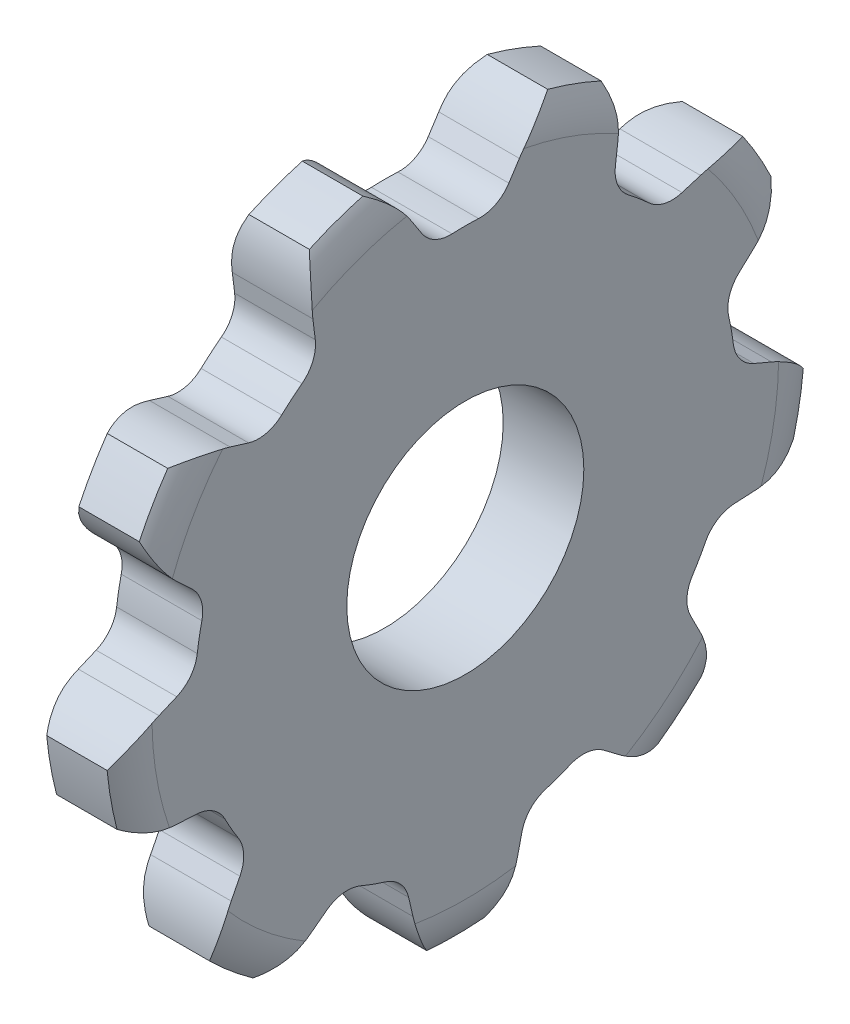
from build123d import *

# Parameters (mm, degrees)
TOOTHCUT_DEPTH  = 54.667092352
TEETHCUTS_COUNT = 9
TEETHCUTS_ANGLE = 320
BORSKE_R        = 12.7
BORE_DEPTH      = 22.3520508


with BuildPart() as part:
    # BasProSke → Base-Revolve (revolve)
    with BuildSketch(Plane(origin=(0, 0, 0), x_dir=(1, 0, 0), z_dir=(0, 1, 0)), mode=Mode.PRIVATE) as base_revolve_sk:
        with BuildLine():
            Line((0, 0), (0, 33.567613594))
            ThreePointArc((0, 33.567613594), (0.274889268, 35.58428602), (1.0795, 37.453813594))
            Line((1.0795, 37.453813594), (7.5565, 37.453813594))
            ThreePointArc((7.5565, 37.453813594), (8.361110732, 35.58428602), (8.636, 33.567613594))
            Line((8.636, 33.567613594), (8.636, 0))
            Line((8.636, 0), (0, 0))
        make_face()
    revolve(base_revolve_sk.sketch.rotate(Axis((-10, 0, 0), (1, 0, 0)), 180), axis=Axis((-10, 0, 0), (1, 0, 0)))

    # TooCutSke → ToothCut (cut, through all)
    with BuildSketch(Plane(origin=(0, 0, 0), x_dir=(0, 0, -1), z_dir=(1, 0, 0))):
        with BuildLine():
            Line((-4.666651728, 30.571549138), (-5.792172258, 32.304698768))
            ThreePointArc((-5.792172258, 32.304698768), (-9.160912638, 35.675881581), (-13.608353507, 37.388643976))
            ThreePointArc((-13.608353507, 37.388643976), (0, 39.788163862), (13.608353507, 37.388643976))
            ThreePointArc((13.608353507, 37.388643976), (9.160912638, 35.675881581), (5.792172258, 32.304698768))
            Line((5.792172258, 32.304698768), (4.666651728, 30.571549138))
            ThreePointArc((4.666651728, 30.571549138), (3.265006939, 29.307412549), (1.419729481, 28.910423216))
            ThreePointArc((1.419729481, 28.910423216), (0, 28.945262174), (-1.419729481, 28.910423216))
            ThreePointArc((-1.419729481, 28.910423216), (-3.265006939, 29.307412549), (-4.666651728, 30.571549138))
        make_face()
    toothcut = extrude(amount=TOOTHCUT_DEPTH, mode=Mode.SUBTRACT)

    # TeethCuts: ToothCut ×9 about axis
    teethcuts_axis = Axis((-10, 0, 0), (1, 0, 0))
    for i in range(1, TEETHCUTS_COUNT):
        add(toothcut.rotate(teethcuts_axis, i * TEETHCUTS_ANGLE / (TEETHCUTS_COUNT - 1)), mode=Mode.SUBTRACT)

    # BorSke → Bore (cut, symmetric)
    with BuildSketch(Plane(origin=(0, 0, 0), x_dir=(0, 0, -1), z_dir=(1, 0, 0))):
        with Locations(Location((0, 0, 0), (0, 0, 180))):
            Circle(BORSKE_R)
    extrude(amount=BORE_DEPTH, both=True, mode=Mode.SUBTRACT)


solid = part.part
